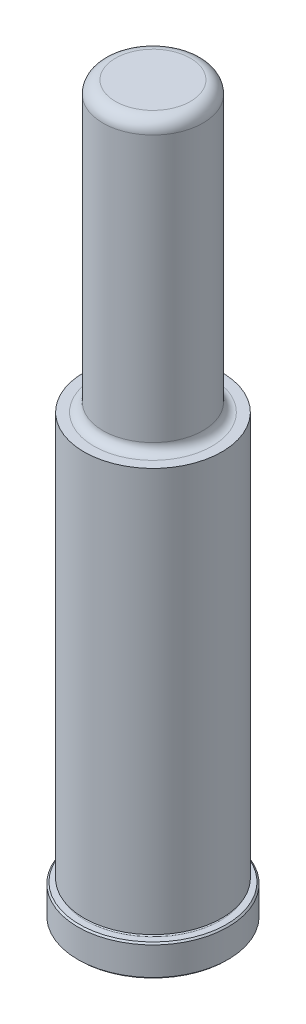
ISO-10303-21;
HEADER;
FILE_DESCRIPTION(('STEP AP214'),'2;1');
FILE_NAME('part.step','',(''),(''),'','','');
FILE_SCHEMA(('AUTOMOTIVE_DESIGN { 1 0 10303 214 1 1 1 1 }'));
ENDSEC;
DATA;
#1=APPLICATION_CONTEXT('core data for automotive mechanical design processes');
#2=APPLICATION_PROTOCOL_DEFINITION('international standard','automotive_design',2000,#1);
#3=PRODUCT_CONTEXT('',#1,'mechanical');
#4=PRODUCT('Part','Part','',(#3));
#5=PRODUCT_RELATED_PRODUCT_CATEGORY('part','',(#4));
#6=PRODUCT_DEFINITION_FORMATION('','',#4);
#7=PRODUCT_DEFINITION_CONTEXT('part definition',#1,'design');
#8=PRODUCT_DEFINITION('design','',#6,#7);
#9=PRODUCT_DEFINITION_SHAPE('','',#8);
#10=(LENGTH_UNIT() NAMED_UNIT(*) SI_UNIT(.MILLI.,.METRE.));
#11=(NAMED_UNIT(*) PLANE_ANGLE_UNIT() SI_UNIT($,.RADIAN.));
#12=(NAMED_UNIT(*) SI_UNIT($,.STERADIAN.) SOLID_ANGLE_UNIT());
#13=UNCERTAINTY_MEASURE_WITH_UNIT(LENGTH_MEASURE(1.E-05),#10,'distance_accuracy_value','');
#14=(GEOMETRIC_REPRESENTATION_CONTEXT(3) GLOBAL_UNCERTAINTY_ASSIGNED_CONTEXT((#13)) GLOBAL_UNIT_ASSIGNED_CONTEXT((#10,
#11,#12)) REPRESENTATION_CONTEXT('',''));
#15=CARTESIAN_POINT('',(0.,0.,0.));
#16=DIRECTION('',(0.,0.,1.));
#17=DIRECTION('',(1.,0.,0.));
#18=AXIS2_PLACEMENT_3D('',#15,#16,#17);
#19=CARTESIAN_POINT('',(0.,0.,0.));
#20=DIRECTION('',(0.,1.,0.));
#21=DIRECTION('',(0.,0.,1.));
#22=AXIS2_PLACEMENT_3D('',#19,#20,#21);
#23=PLANE('',#22);
#24=CARTESIAN_POINT('',(0.,0.,0.));
#25=DIRECTION('',(0.,1.,0.));
#26=DIRECTION('',(0.,0.,1.));
#27=AXIS2_PLACEMENT_3D('',#24,#25,#26);
#28=CIRCLE('',#27,18.6690000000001);
#29=CARTESIAN_POINT('',(0.,0.,18.6690000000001));
#30=VERTEX_POINT('',#29);
#31=EDGE_CURVE('E46',#30,#30,#28,.F.);
#32=ORIENTED_EDGE('',*,*,#31,.T.);
#33=EDGE_LOOP('',(#32));
#34=FACE_BOUND('',#33,.T.);
#35=ADVANCED_FACE('F31',(#34),#23,.F.);
#36=CARTESIAN_POINT('',(0.,0.,0.));
#37=DIRECTION('',(0.,1.,0.));
#38=DIRECTION('',(0.,0.,1.));
#39=AXIS2_PLACEMENT_3D('',#36,#37,#38);
#40=CYLINDRICAL_SURFACE('',#39,19.05);
#41=CARTESIAN_POINT('',(0.,0.38099999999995,0.));
#42=DIRECTION('',(0.,1.,0.));
#43=DIRECTION('',(0.,0.,1.));
#44=AXIS2_PLACEMENT_3D('',#41,#42,#43);
#45=CIRCLE('',#44,19.05);
#46=CARTESIAN_POINT('',(0.,0.380999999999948,19.05));
#47=VERTEX_POINT('',#46);
#48=EDGE_CURVE('E51',#47,#47,#45,.T.);
#49=ORIENTED_EDGE('',*,*,#48,.T.);
#50=EDGE_LOOP('',(#49));
#51=FACE_BOUND('',#50,.T.);
#52=CARTESIAN_POINT('',(0.,7.5438,0.));
#53=DIRECTION('',(0.,-1.,0.));
#54=DIRECTION('',(0.,0.,-1.));
#55=AXIS2_PLACEMENT_3D('',#52,#53,#54);
#56=CIRCLE('',#55,19.05);
#57=CARTESIAN_POINT('',(0.,7.5438,-19.05));
#58=VERTEX_POINT('',#57);
#59=EDGE_CURVE('E54',#58,#58,#56,.T.);
#60=ORIENTED_EDGE('',*,*,#59,.T.);
#61=EDGE_LOOP('',(#60));
#62=FACE_BOUND('',#61,.T.);
#63=ADVANCED_FACE('F110',(#51,#62),#40,.T.);
#64=CARTESIAN_POINT('',(0.,7.9248,-19.05));
#65=DIRECTION('',(0.,-1.,0.));
#66=DIRECTION('',(0.,0.,-1.));
#67=AXIS2_PLACEMENT_3D('',#64,#65,#66);
#68=PLANE('',#67);
#69=CARTESIAN_POINT('',(0.,7.9248,0.));
#70=DIRECTION('',(0.,-1.,0.));
#71=DIRECTION('',(0.,0.,-1.));
#72=AXIS2_PLACEMENT_3D('',#69,#70,#71);
#73=CIRCLE('',#72,18.669);
#74=CARTESIAN_POINT('',(0.,7.9248,-18.669));
#75=VERTEX_POINT('',#74);
#76=EDGE_CURVE('E42',#75,#75,#73,.F.);
#77=ORIENTED_EDGE('',*,*,#76,.T.);
#78=EDGE_LOOP('',(#77));
#79=FACE_BOUND('',#78,.T.);
#80=CARTESIAN_POINT('',(0.,7.9248,0.));
#81=DIRECTION('',(0.,1.,0.));
#82=DIRECTION('',(0.,0.,1.));
#83=AXIS2_PLACEMENT_3D('',#80,#81,#82);
#84=CIRCLE('',#83,17.0688);
#85=CARTESIAN_POINT('',(0.,7.92479999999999,17.0688));
#86=VERTEX_POINT('',#85);
#87=EDGE_CURVE('E57',#86,#86,#84,.T.);
#88=ORIENTED_EDGE('',*,*,#87,.F.);
#89=EDGE_LOOP('',(#88));
#90=FACE_BOUND('',#89,.T.);
#91=ADVANCED_FACE('F105',(#79,#90),#68,.F.);
#92=CARTESIAN_POINT('',(0.,8.3058,0.));
#93=DIRECTION('',(0.,1.,0.));
#94=DIRECTION('',(0.,0.,1.));
#95=AXIS2_PLACEMENT_3D('',#92,#93,#94);
#96=TOROIDAL_SURFACE('',#95,17.0688,0.381000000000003);
#97=CARTESIAN_POINT('',(0.,8.6868,0.));
#98=DIRECTION('',(0.,1.,0.));
#99=DIRECTION('',(0.,0.,1.));
#100=AXIS2_PLACEMENT_3D('',#97,#98,#99);
#101=CIRCLE('',#100,17.0688);
#102=CARTESIAN_POINT('',(0.,8.6868,17.0688));
#103=VERTEX_POINT('',#102);
#104=EDGE_CURVE('E60',#103,#103,#101,.T.);
#105=ORIENTED_EDGE('',*,*,#104,.F.);
#106=EDGE_LOOP('',(#105));
#107=FACE_BOUND('',#106,.T.);
#108=ORIENTED_EDGE('',*,*,#87,.T.);
#109=EDGE_LOOP('',(#108));
#110=FACE_BOUND('',#109,.T.);
#111=ADVANCED_FACE('F99',(#107,#110),#96,.F.);
#112=CARTESIAN_POINT('',(0.,8.6868,-17.0688));
#113=DIRECTION('',(0.,1.,0.));
#114=DIRECTION('',(0.,0.,1.));
#115=AXIS2_PLACEMENT_3D('',#112,#113,#114);
#116=PLANE('',#115);
#117=CARTESIAN_POINT('',(0.,8.6868,0.));
#118=DIRECTION('',(0.,1.,0.));
#119=DIRECTION('',(0.,0.,1.));
#120=AXIS2_PLACEMENT_3D('',#117,#118,#119);
#121=CIRCLE('',#120,17.4752);
#122=CARTESIAN_POINT('',(0.,8.6868,17.4752));
#123=VERTEX_POINT('',#122);
#124=EDGE_CURVE('E63',#123,#123,#121,.T.);
#125=ORIENTED_EDGE('',*,*,#124,.F.);
#126=EDGE_LOOP('',(#125));
#127=FACE_BOUND('',#126,.T.);
#128=ORIENTED_EDGE('',*,*,#104,.T.);
#129=EDGE_LOOP('',(#128));
#130=FACE_BOUND('',#129,.T.);
#131=ADVANCED_FACE('F93',(#127,#130),#116,.F.);
#132=CARTESIAN_POINT('',(0.,0.,0.));
#133=DIRECTION('',(0.,1.,0.));
#134=DIRECTION('',(0.,0.,1.));
#135=AXIS2_PLACEMENT_3D('',#132,#133,#134);
#136=CYLINDRICAL_SURFACE('',#135,17.4752);
#137=CARTESIAN_POINT('',(0.,111.125,0.));
#138=DIRECTION('',(0.,1.,0.));
#139=DIRECTION('',(0.,0.,1.));
#140=AXIS2_PLACEMENT_3D('',#137,#138,#139);
#141=CIRCLE('',#140,17.4752);
#142=CARTESIAN_POINT('',(0.,111.125,17.4752));
#143=VERTEX_POINT('',#142);
#144=EDGE_CURVE('E66',#143,#143,#141,.T.);
#145=ORIENTED_EDGE('',*,*,#144,.F.);
#146=EDGE_LOOP('',(#145));
#147=FACE_BOUND('',#146,.T.);
#148=ORIENTED_EDGE('',*,*,#124,.T.);
#149=EDGE_LOOP('',(#148));
#150=FACE_BOUND('',#149,.T.);
#151=ADVANCED_FACE('F87',(#147,#150),#136,.T.);
#152=CARTESIAN_POINT('',(0.,111.125,-17.4752));
#153=DIRECTION('',(0.,-1.,0.));
#154=DIRECTION('',(0.,0.,-1.));
#155=AXIS2_PLACEMENT_3D('',#152,#153,#154);
#156=PLANE('',#155);
#157=CARTESIAN_POINT('',(0.,111.125,0.));
#158=DIRECTION('',(0.,1.,0.));
#159=DIRECTION('',(0.,0.,1.));
#160=AXIS2_PLACEMENT_3D('',#157,#158,#159);
#161=CIRCLE('',#160,14.9733);
#162=CARTESIAN_POINT('',(0.,111.125,14.9733));
#163=VERTEX_POINT('',#162);
#164=EDGE_CURVE('E69',#163,#163,#161,.T.);
#165=ORIENTED_EDGE('',*,*,#164,.F.);
#166=EDGE_LOOP('',(#165));
#167=FACE_BOUND('',#166,.T.);
#168=ORIENTED_EDGE('',*,*,#144,.T.);
#169=EDGE_LOOP('',(#168));
#170=FACE_BOUND('',#169,.T.);
#171=ADVANCED_FACE('F81',(#167,#170),#156,.F.);
#172=CARTESIAN_POINT('',(0.,113.411,0.));
#173=DIRECTION('',(0.,1.,0.));
#174=DIRECTION('',(0.,0.,1.));
#175=AXIS2_PLACEMENT_3D('',#172,#173,#174);
#176=TOROIDAL_SURFACE('',#175,14.9733,2.286);
#177=CARTESIAN_POINT('',(0.,113.411,0.));
#178=DIRECTION('',(0.,1.,0.));
#179=DIRECTION('',(0.,0.,1.));
#180=AXIS2_PLACEMENT_3D('',#177,#178,#179);
#181=CIRCLE('',#180,12.6873);
#182=CARTESIAN_POINT('',(0.,113.411,12.6873));
#183=VERTEX_POINT('',#182);
#184=EDGE_CURVE('E72',#183,#183,#181,.T.);
#185=ORIENTED_EDGE('',*,*,#184,.F.);
#186=EDGE_LOOP('',(#185));
#187=FACE_BOUND('',#186,.T.);
#188=ORIENTED_EDGE('',*,*,#164,.T.);
#189=EDGE_LOOP('',(#188));
#190=FACE_BOUND('',#189,.T.);
#191=ADVANCED_FACE('F78',(#187,#190),#176,.F.);
#192=CARTESIAN_POINT('',(0.,0.,0.));
#193=DIRECTION('',(0.,1.,0.));
#194=DIRECTION('',(0.,0.,1.));
#195=AXIS2_PLACEMENT_3D('',#192,#193,#194);
#196=CYLINDRICAL_SURFACE('',#195,12.6873);
#197=CARTESIAN_POINT('',(0.,180.975,0.));
#198=DIRECTION('',(0.,-1.,0.));
#199=DIRECTION('',(0.,0.,-1.));
#200=AXIS2_PLACEMENT_3D('',#197,#198,#199);
#201=CIRCLE('',#200,12.6873);
#202=CARTESIAN_POINT('',(0.,180.975,-12.6873));
#203=VERTEX_POINT('',#202);
#204=EDGE_CURVE('E10',#203,#203,#201,.T.);
#205=ORIENTED_EDGE('',*,*,#204,.T.);
#206=EDGE_LOOP('',(#205));
#207=FACE_BOUND('',#206,.T.);
#208=ORIENTED_EDGE('',*,*,#184,.T.);
#209=EDGE_LOOP('',(#208));
#210=FACE_BOUND('',#209,.T.);
#211=ADVANCED_FACE('F76',(#207,#210),#196,.T.);
#212=CARTESIAN_POINT('',(0.,184.15,-12.6873));
#213=DIRECTION('',(0.,-1.,0.));
#214=DIRECTION('',(0.,0.,-1.));
#215=AXIS2_PLACEMENT_3D('',#212,#213,#214);
#216=PLANE('',#215);
#217=CARTESIAN_POINT('',(0.,184.15,0.));
#218=DIRECTION('',(0.,-1.,0.));
#219=DIRECTION('',(0.,0.,-1.));
#220=AXIS2_PLACEMENT_3D('',#217,#218,#219);
#221=CIRCLE('',#220,9.51230000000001);
#222=CARTESIAN_POINT('',(0.,184.15,-9.51229999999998));
#223=VERTEX_POINT('',#222);
#224=EDGE_CURVE('E38',#223,#223,#221,.F.);
#225=ORIENTED_EDGE('',*,*,#224,.T.);
#226=EDGE_LOOP('',(#225));
#227=FACE_BOUND('',#226,.T.);
#228=ADVANCED_FACE('F127',(#227),#216,.F.);
#229=CARTESIAN_POINT('',(0.,0.38099999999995,0.));
#230=DIRECTION('',(0.,1.,0.));
#231=DIRECTION('',(0.,0.,1.));
#232=AXIS2_PLACEMENT_3D('',#229,#230,#231);
#233=CONICAL_SURFACE('',#232,19.05,0.785398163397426);
#234=ORIENTED_EDGE('',*,*,#31,.F.);
#235=EDGE_LOOP('',(#234));
#236=FACE_BOUND('',#235,.T.);
#237=ORIENTED_EDGE('',*,*,#48,.F.);
#238=EDGE_LOOP('',(#237));
#239=FACE_BOUND('',#238,.T.);
#240=ADVANCED_FACE('F124',(#236,#239),#233,.T.);
#241=CARTESIAN_POINT('',(0.,7.9248,0.));
#242=DIRECTION('',(0.,-1.,0.));
#243=DIRECTION('',(0.,0.,-1.));
#244=AXIS2_PLACEMENT_3D('',#241,#242,#243);
#245=CONICAL_SURFACE('',#244,18.669,0.785398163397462);
#246=ORIENTED_EDGE('',*,*,#59,.F.);
#247=EDGE_LOOP('',(#246));
#248=FACE_BOUND('',#247,.T.);
#249=ORIENTED_EDGE('',*,*,#76,.F.);
#250=EDGE_LOOP('',(#249));
#251=FACE_BOUND('',#250,.T.);
#252=ADVANCED_FACE('F126',(#248,#251),#245,.T.);
#253=CARTESIAN_POINT('',(0.,180.975,0.));
#254=DIRECTION('',(0.,-1.,0.));
#255=DIRECTION('',(0.,0.,-1.));
#256=AXIS2_PLACEMENT_3D('',#253,#254,#255);
#257=TOROIDAL_SURFACE('',#256,9.51230000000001,3.175);
#258=ORIENTED_EDGE('',*,*,#204,.F.);
#259=EDGE_LOOP('',(#258));
#260=FACE_BOUND('',#259,.T.);
#261=ORIENTED_EDGE('',*,*,#224,.F.);
#262=EDGE_LOOP('',(#261));
#263=FACE_BOUND('',#262,.T.);
#264=ADVANCED_FACE('F33',(#260,#263),#257,.T.);
#265=CLOSED_SHELL('',(#35,#63,#91,#111,#131,#151,#171,#191,#211,#228,#240,#252,#264));
#266=MANIFOLD_SOLID_BREP('B2',#265);
#267=ADVANCED_BREP_SHAPE_REPRESENTATION('',(#18,#266),#14);
#268=SHAPE_DEFINITION_REPRESENTATION(#9,#267);
ENDSEC;
END-ISO-10303-21;
